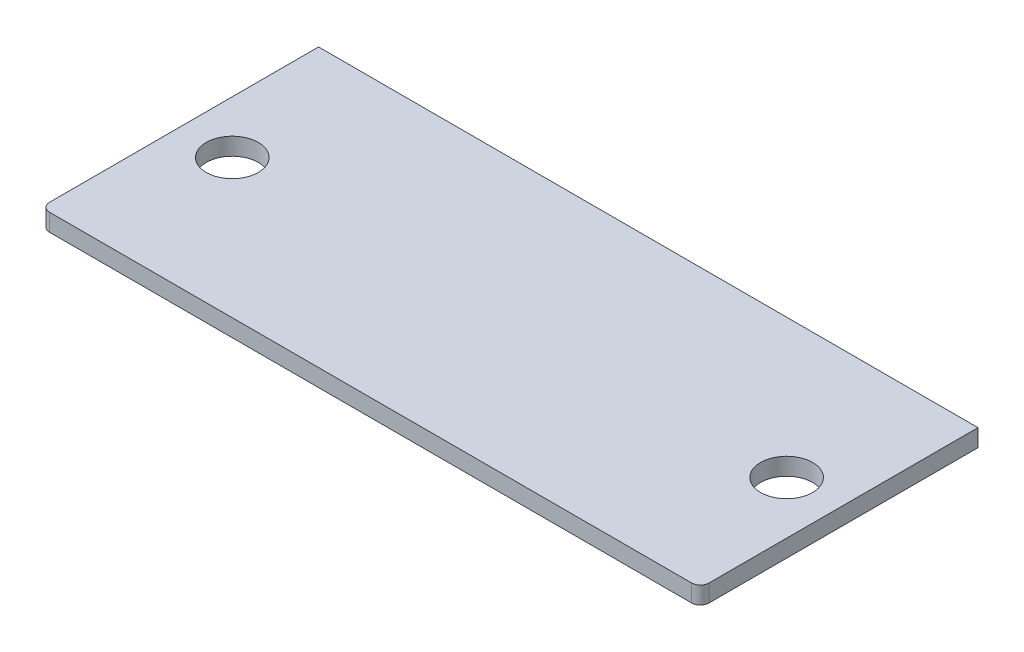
from build123d import *

# Parameters (mm, degrees)
ESQUISSE1_W      = 38
ESQUISSE1_H      = 16
ESQUISSE1_R      = 1.5
EXTRUSION1_DEPTH = 1
CONG_1_R         = 0.5


with BuildPart() as part:
    # Esquisse1 → Extrusion1 (new body)
    with BuildSketch(Plane(origin=(0, 0, 0), x_dir=(1, 0, 0), z_dir=(0, 1, 0))):
        with Locations((19, 8)):
            Rectangle(ESQUISSE1_W, ESQUISSE1_H)
        with Locations(Location((34.971565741, 8, 0), (0, 0, 270))):
            Circle(ESQUISSE1_R, mode=Mode.SUBTRACT)
        with Locations(Location((3.028434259, 8, 0), (0, 0, 90))):
            Circle(ESQUISSE1_R, mode=Mode.SUBTRACT)
    extrude(amount=EXTRUSION1_DEPTH)

    # Cong_1
    cong_1_edges = [part.edges().sort_by_distance(p)[0] for p in [
        (38, 0.5, 0),
        (0, 0.5, 0),
    ]]
    fillet(cong_1_edges, radius=CONG_1_R)


solid = part.part
